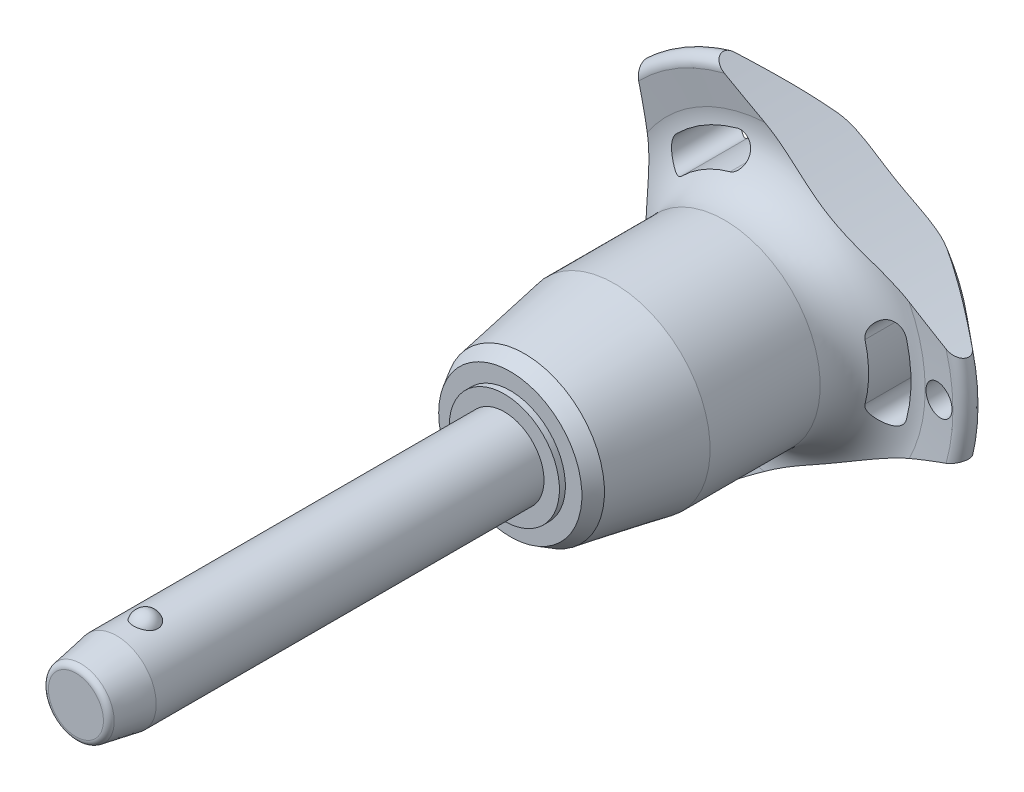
from build123d import *

# Parameters (mm, degrees)
SKETCH1_R           = 4
BOSS_EXTRUDE1_DEPTH = 35
SKETCH2_R           = 3.4
BOSS_EXTRUDE2_DEPTH = 33.3
BOSS_EXTRUDE3_START = 8.2
SKETCH1_2_R         = 4
BOSS_EXTRUDE3_DEPTH = 8.2
CHAMFER1_SIZE       = 4.1
CHAMFER1_SIZE2      = 0.722940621
FILLET1_R           = 0.6
SKETCH6_R           = 102.8
CUT_EXTRUDE1_DEPTH  = 74.713650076
CIRPATTERN1_COUNT   = 3
SKETCH7_R           = 1.5
CUT_EXTRUDE2_DEPTH  = 74.493908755


with BuildPart() as part:
    # Sketch1 → Boss-Extrude1 (new body)
    with BuildSketch(Plane.XY):
        Circle(SKETCH1_R)
    extrude(amount=-BOSS_EXTRUDE1_DEPTH)

    # Sketch2 → Boss-Extrude2 (add)
    with BuildSketch(Plane(origin=(0, 0, -35), x_dir=(-1, 0, 0), z_dir=(0, 0, -1))):
        Circle(SKETCH2_R)
    extrude(amount=BOSS_EXTRUDE2_DEPTH)

    # Sketch3 → Revolve1 (revolve)
    with BuildSketch(Plane(origin=(0, 0, 0), x_dir=(0, 0, -1), z_dir=(1, 0, 0))):
        with BuildLine():
            Line((-1.2, 4.8), (-1.2, 2.2))
            ThreePointArc((-1.2, 2.2), (0.1, 3.5), (-1.2, 4.8))
        make_face()
        with BuildLine():
            Line((-1.2, -2.2), (-1.2, -4.8))
            ThreePointArc((-1.2, -4.8), (0.1, -3.5), (-1.2, -2.2))
        make_face()
    revolve(axis=Axis((0, -2.2, 1.2), (0, 1, 0)))

    # Sketch1_2 → Boss-Extrude3 (add)
    with BuildSketch(Plane.XY.offset(BOSS_EXTRUDE3_START)):
        Circle(SKETCH1_2_R)
    extrude(amount=-BOSS_EXTRUDE3_DEPTH)

    # Chamfer1
    chamfer1_edges = [part.edges().sort_by_distance(p)[0] for p in [
        (-4, 0, 8.2),
    ]]
    chamfer1_side = [part.faces().sort_by_distance(p)[0] for p in [
        (-4, 0, -13.4),
    ]]
    chamfer(chamfer1_edges, length=CHAMFER1_SIZE, length2=CHAMFER1_SIZE2, reference=chamfer1_side[0])

    # Fillet1
    fillet1_edges = [part.edges().sort_by_distance(p)[0] for p in [
        (-3.277059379, 0, 8.2),
        (3.4, 0, -68.3),
    ]]
    fillet(fillet1_edges, radius=FILLET1_R)

    # Sketch4 → Revolve2 (revolve)
    with BuildSketch(Plane(origin=(0, 0, 0), x_dir=(0, 0, -1), z_dir=(1, 0, 0)), mode=Mode.PRIVATE) as revolve2_sk:
        Polygon((35, 0), (35, 5.554101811), (35.6, 5.554101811), (35.6, 7.220004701), (37.042714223, 8.052956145), (46.1, 9.65), (57.2, 9.65), (57.2, 0), align=None)
    revolve(revolve2_sk.sketch.rotate(Axis((0, 0, -57.2), (0, 0, 1)), 90), axis=Axis((0, 0, -57.2), (0, 0, 1)))

    # Sketch5 → Revolve3 (revolve)
    with BuildSketch(Plane(origin=(0, 0, 0), x_dir=(0, 0, -1), z_dir=(1, 0, 0)), mode=Mode.PRIVATE) as revolve3_sk:
        with BuildLine():
            Line((62.16082631, 15.274661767), (61.757834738, 18.475067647))
            ThreePointArc((61.757834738, 18.475067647), (62.349836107, 19.516443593), (63.516044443, 19.24278761))
            Line((63.516044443, 19.24278761), (67.835691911, 14.094832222))
            ThreePointArc((67.835691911, 14.094832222), (68.3, 12.689260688), (67.67067517, 11.349423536))
            ThreePointArc((67.67067517, 11.349423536), (64.033110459, 6.185112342), (62.75, 0))
            Line((62.75, 0), (57.2, 0))
            Line((57.2, 0), (57.2, 9.65))
            ThreePointArc((57.2, 9.65), (60.949887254, 11.342683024), (62.16082631, 15.274661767))
        make_face()
    revolve(revolve3_sk.sketch.rotate(Axis((0, 0, -62.75), (0, 0, 1)), 90), axis=Axis((0, 0, -62.75), (0, 0, 1)))

    # Sketch6 → Cut-Extrude1 (cut, through all)
    with BuildSketch(Plane.XY):
        with Locations((-115.2, 0)):
            Circle(SKETCH6_R)
        with BuildLine():
            ThreePointArc((13.411913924, -3.529271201), (13.868496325, 0), (13.411913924, 3.529271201))
            ThreePointArc((13.411913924, 3.529271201), (11.694200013, 4.531299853), (10.692171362, 2.813585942))
            ThreePointArc((10.692171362, 2.813585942), (11.056165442, 0), (10.692171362, -2.813585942))
            ThreePointArc((10.692171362, -2.813585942), (11.694200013, -4.531299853), (13.411913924, -3.529271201))
        make_face()
    cut_extrude1 = extrude(amount=-CUT_EXTRUDE1_DEPTH, mode=Mode.SUBTRACT)

    # CirPattern1: Cut-Extrude1 ×3 about axis
    cirpattern1_axis = Axis((0, 0, 0), (0, 0, 1))
    for i in range(1, CIRPATTERN1_COUNT):
        add(cut_extrude1.rotate(cirpattern1_axis, i * 360 / CIRPATTERN1_COUNT), mode=Mode.SUBTRACT)

    # Sketch7 → Cut-Extrude2 (cut, through all)
    with BuildSketch(Plane.XY):
        with Locations(Location((16.868496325, 0, 0), (0, 0, 225.467095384))):
            Circle(SKETCH7_R)
    extrude(amount=-CUT_EXTRUDE2_DEPTH, mode=Mode.SUBTRACT)


solid = part.part
